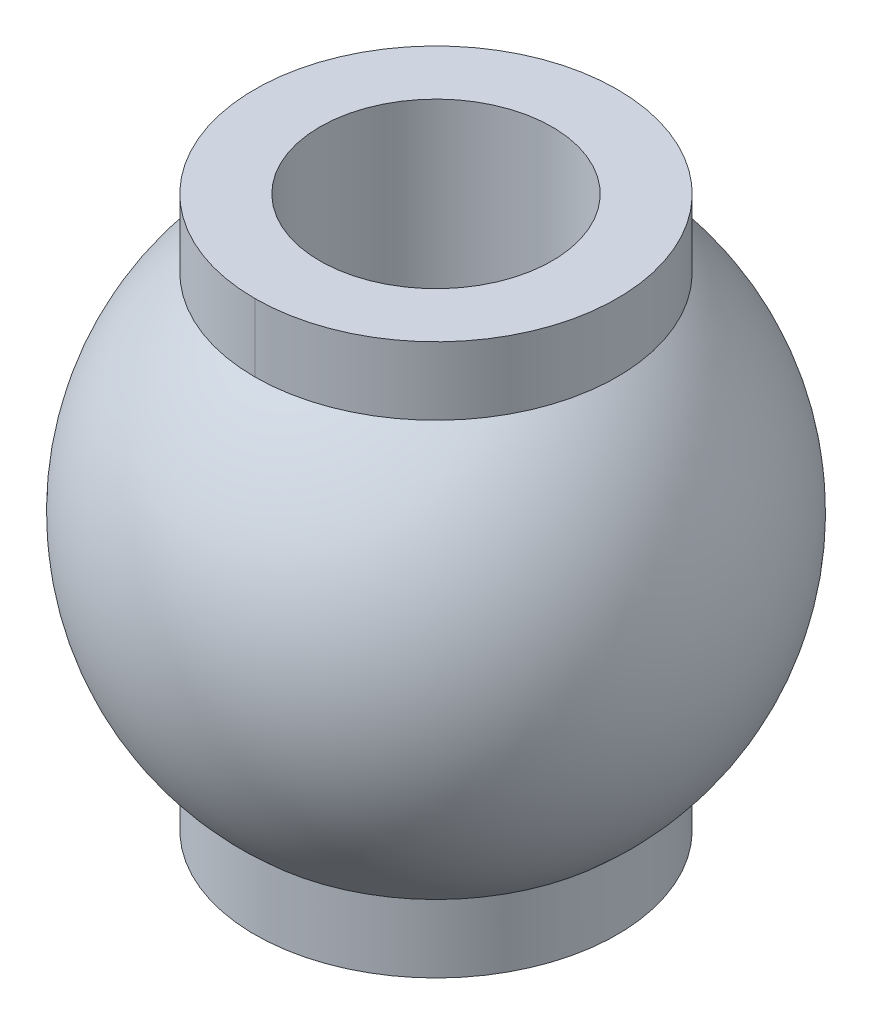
ISO-10303-21;
HEADER;
FILE_DESCRIPTION(('STEP AP214'),'2;1');
FILE_NAME('part.step','',(''),(''),'','','');
FILE_SCHEMA(('AUTOMOTIVE_DESIGN { 1 0 10303 214 1 1 1 1 }'));
ENDSEC;
DATA;
#1=APPLICATION_CONTEXT('core data for automotive mechanical design processes');
#2=APPLICATION_PROTOCOL_DEFINITION('international standard','automotive_design',2000,#1);
#3=PRODUCT_CONTEXT('',#1,'mechanical');
#4=PRODUCT('Part','Part','',(#3));
#5=PRODUCT_RELATED_PRODUCT_CATEGORY('part','',(#4));
#6=PRODUCT_DEFINITION_FORMATION('','',#4);
#7=PRODUCT_DEFINITION_CONTEXT('part definition',#1,'design');
#8=PRODUCT_DEFINITION('design','',#6,#7);
#9=PRODUCT_DEFINITION_SHAPE('','',#8);
#10=(LENGTH_UNIT() NAMED_UNIT(*) SI_UNIT(.MILLI.,.METRE.));
#11=(NAMED_UNIT(*) PLANE_ANGLE_UNIT() SI_UNIT($,.RADIAN.));
#12=(NAMED_UNIT(*) SI_UNIT($,.STERADIAN.) SOLID_ANGLE_UNIT());
#13=UNCERTAINTY_MEASURE_WITH_UNIT(LENGTH_MEASURE(1.E-05),#10,'distance_accuracy_value','');
#14=(GEOMETRIC_REPRESENTATION_CONTEXT(3) GLOBAL_UNCERTAINTY_ASSIGNED_CONTEXT((#13)) GLOBAL_UNIT_ASSIGNED_CONTEXT((#10,
#11,#12)) REPRESENTATION_CONTEXT('',''));
#15=CARTESIAN_POINT('',(0.,0.,0.));
#16=DIRECTION('',(0.,0.,1.));
#17=DIRECTION('',(1.,0.,0.));
#18=AXIS2_PLACEMENT_3D('',#15,#16,#17);
#19=CARTESIAN_POINT('',(0.,21.5066934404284,0.));
#20=DIRECTION('',(0.,1.,0.));
#21=DIRECTION('',(-1.,0.,0.));
#22=AXIS2_PLACEMENT_3D('',#19,#20,#21);
#23=CYLINDRICAL_SURFACE('',#22,4.95300000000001);
#24=CARTESIAN_POINT('',(0.,5.67320528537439,0.));
#25=DIRECTION('',(0.,1.,0.));
#26=DIRECTION('',(-1.,0.,0.));
#27=AXIS2_PLACEMENT_3D('',#24,#25,#26);
#28=CIRCLE('',#27,4.95300000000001);
#29=CARTESIAN_POINT('',(0.,5.67320528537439,-4.95300000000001));
#30=VERTEX_POINT('',#29);
#31=CARTESIAN_POINT('',(0.,5.67320528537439,4.95300000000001));
#32=VERTEX_POINT('',#31);
#33=EDGE_CURVE('E72',#30,#32,#28,.T.);
#34=ORIENTED_EDGE('',*,*,#33,.T.);
#35=DIRECTION('',(0.,1.,0.));
#36=VECTOR('',#35,1.);
#37=CARTESIAN_POINT('',(0.,21.5066934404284,4.95300000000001));
#38=LINE('',#37,#36);
#39=CARTESIAN_POINT('',(0.,7.5311,4.95300000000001));
#40=VERTEX_POINT('',#39);
#41=EDGE_CURVE('E11',#32,#40,#38,.T.);
#42=ORIENTED_EDGE('',*,*,#41,.T.);
#43=CARTESIAN_POINT('',(0.,7.5311,0.));
#44=DIRECTION('',(0.,1.,0.));
#45=DIRECTION('',(-1.,0.,0.));
#46=AXIS2_PLACEMENT_3D('',#43,#44,#45);
#47=CIRCLE('',#46,4.95300000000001);
#48=CARTESIAN_POINT('',(0.,7.5311,-4.95300000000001));
#49=VERTEX_POINT('',#48);
#50=EDGE_CURVE('E64',#49,#40,#47,.T.);
#51=ORIENTED_EDGE('',*,*,#50,.F.);
#52=DIRECTION('',(0.,-1.,0.));
#53=VECTOR('',#52,1.);
#54=CARTESIAN_POINT('',(0.,21.5066934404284,-4.95300000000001));
#55=LINE('',#54,#53);
#56=EDGE_CURVE('E45',#49,#30,#55,.T.);
#57=ORIENTED_EDGE('',*,*,#56,.T.);
#58=EDGE_LOOP('',(#34,#42,#51,#57));
#59=FACE_BOUND('',#58,.T.);
#60=ADVANCED_FACE('F36',(#59),#23,.T.);
#61=CARTESIAN_POINT('',(3.175,7.5311,0.));
#62=DIRECTION('',(0.,-1.,0.));
#63=DIRECTION('',(1.,0.,0.));
#64=AXIS2_PLACEMENT_3D('',#61,#62,#63);
#65=PLANE('',#64);
#66=CARTESIAN_POINT('',(0.,7.5311,0.));
#67=DIRECTION('',(0.,1.,0.));
#68=DIRECTION('',(-1.,0.,0.));
#69=AXIS2_PLACEMENT_3D('',#66,#67,#68);
#70=CIRCLE('',#69,3.17500000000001);
#71=CARTESIAN_POINT('',(-3.17500000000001,7.5311,0.));
#72=VERTEX_POINT('',#71);
#73=EDGE_CURVE('E71',#72,#72,#70,.T.);
#74=ORIENTED_EDGE('',*,*,#73,.F.);
#75=EDGE_LOOP('',(#74));
#76=FACE_BOUND('',#75,.T.);
#77=ORIENTED_EDGE('',*,*,#50,.T.);
#78=EDGE_CURVE('E62',#40,#49,#47,.T.);
#79=ORIENTED_EDGE('',*,*,#78,.T.);
#80=EDGE_LOOP('',(#77,#79));
#81=FACE_BOUND('',#80,.T.);
#82=ADVANCED_FACE('F38',(#76,#81),#65,.F.);
#83=CARTESIAN_POINT('',(0.,21.5066934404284,0.));
#84=DIRECTION('',(0.,1.,0.));
#85=DIRECTION('',(-1.,0.,0.));
#86=AXIS2_PLACEMENT_3D('',#83,#84,#85);
#87=CYLINDRICAL_SURFACE('',#86,3.17500000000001);
#88=CARTESIAN_POINT('',(0.,-7.5311,0.));
#89=DIRECTION('',(0.,1.,0.));
#90=DIRECTION('',(-1.,0.,0.));
#91=AXIS2_PLACEMENT_3D('',#88,#89,#90);
#92=CIRCLE('',#91,3.17500000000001);
#93=CARTESIAN_POINT('',(-3.17500000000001,-7.5311,0.));
#94=VERTEX_POINT('',#93);
#95=EDGE_CURVE('E81',#94,#94,#92,.T.);
#96=ORIENTED_EDGE('',*,*,#95,.F.);
#97=EDGE_LOOP('',(#96));
#98=FACE_BOUND('',#97,.T.);
#99=ORIENTED_EDGE('',*,*,#73,.T.);
#100=EDGE_LOOP('',(#99));
#101=FACE_BOUND('',#100,.T.);
#102=ADVANCED_FACE('F87',(#98,#101),#87,.F.);
#103=CARTESIAN_POINT('',(3.175,-7.5311,0.));
#104=DIRECTION('',(0.,1.,0.));
#105=DIRECTION('',(-1.,0.,0.));
#106=AXIS2_PLACEMENT_3D('',#103,#104,#105);
#107=PLANE('',#106);
#108=CARTESIAN_POINT('',(0.,-7.5311,0.));
#109=DIRECTION('',(0.,1.,0.));
#110=DIRECTION('',(-1.,0.,0.));
#111=AXIS2_PLACEMENT_3D('',#108,#109,#110);
#112=CIRCLE('',#111,4.95300000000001);
#113=CARTESIAN_POINT('',(-4.95300000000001,-7.5311,0.));
#114=VERTEX_POINT('',#113);
#115=EDGE_CURVE('E78',#114,#114,#112,.T.);
#116=ORIENTED_EDGE('',*,*,#115,.F.);
#117=EDGE_LOOP('',(#116));
#118=FACE_BOUND('',#117,.T.);
#119=ORIENTED_EDGE('',*,*,#95,.T.);
#120=EDGE_LOOP('',(#119));
#121=FACE_BOUND('',#120,.T.);
#122=ADVANCED_FACE('F94',(#118,#121),#107,.F.);
#123=CARTESIAN_POINT('',(0.,21.5066934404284,0.));
#124=DIRECTION('',(0.,1.,0.));
#125=DIRECTION('',(-1.,0.,0.));
#126=AXIS2_PLACEMENT_3D('',#123,#124,#125);
#127=CYLINDRICAL_SURFACE('',#126,4.953);
#128=CARTESIAN_POINT('',(0.,-5.67320528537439,0.));
#129=DIRECTION('',(0.,1.,0.));
#130=DIRECTION('',(-1.,0.,0.));
#131=AXIS2_PLACEMENT_3D('',#128,#129,#130);
#132=CIRCLE('',#131,4.953);
#133=CARTESIAN_POINT('',(-4.95300000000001,-5.6732052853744,0.));
#134=VERTEX_POINT('',#133);
#135=EDGE_CURVE('E75',#134,#134,#132,.T.);
#136=ORIENTED_EDGE('',*,*,#135,.F.);
#137=EDGE_LOOP('',(#136));
#138=FACE_BOUND('',#137,.T.);
#139=ORIENTED_EDGE('',*,*,#115,.T.);
#140=EDGE_LOOP('',(#139));
#141=FACE_BOUND('',#140,.T.);
#142=ADVANCED_FACE('F105',(#138,#141),#127,.T.);
#143=CARTESIAN_POINT('',(0.,0.,0.));
#144=DIRECTION('',(0.,1.,0.));
#145=DIRECTION('',(1.,0.,0.));
#146=AXIS2_PLACEMENT_3D('',#143,#144,#145);
#147=SPHERICAL_SURFACE('',#146,7.5311);
#148=ORIENTED_EDGE('',*,*,#33,.F.);
#149=EDGE_CURVE('E68',#32,#30,#28,.T.);
#150=ORIENTED_EDGE('',*,*,#149,.F.);
#151=EDGE_LOOP('',(#148,#150));
#152=FACE_BOUND('',#151,.T.);
#153=ORIENTED_EDGE('',*,*,#135,.T.);
#154=EDGE_LOOP('',(#153));
#155=FACE_BOUND('',#154,.T.);
#156=ADVANCED_FACE('F101',(#152,#155),#147,.T.);
#157=ORIENTED_EDGE('',*,*,#41,.F.);
#158=ORIENTED_EDGE('',*,*,#149,.T.);
#159=ORIENTED_EDGE('',*,*,#56,.F.);
#160=ORIENTED_EDGE('',*,*,#78,.F.);
#161=EDGE_LOOP('',(#157,#158,#159,#160));
#162=FACE_BOUND('',#161,.T.);
#163=ADVANCED_FACE('F67',(#162),#23,.T.);
#164=CLOSED_SHELL('',(#60,#82,#102,#122,#142,#156,#163));
#165=MANIFOLD_SOLID_BREP('B2',#164);
#166=ADVANCED_BREP_SHAPE_REPRESENTATION('',(#18,#165),#14);
#167=SHAPE_DEFINITION_REPRESENTATION(#9,#166);
ENDSEC;
END-ISO-10303-21;
